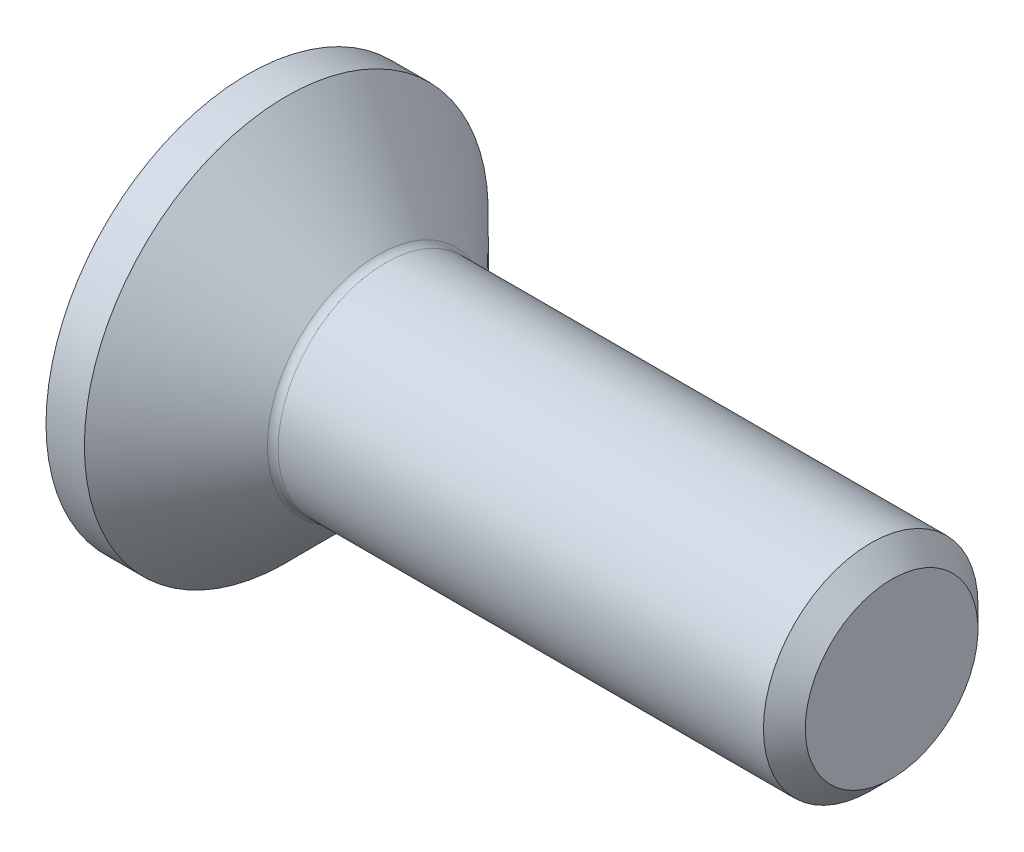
ISO-10303-21;
HEADER;
FILE_DESCRIPTION(('STEP AP214'),'2;1');
FILE_NAME('part.step','',(''),(''),'','','');
FILE_SCHEMA(('AUTOMOTIVE_DESIGN { 1 0 10303 214 1 1 1 1 }'));
ENDSEC;
DATA;
#1=APPLICATION_CONTEXT('core data for automotive mechanical design processes');
#2=APPLICATION_PROTOCOL_DEFINITION('international standard','automotive_design',2000,#1);
#3=PRODUCT_CONTEXT('',#1,'mechanical');
#4=PRODUCT('Part','Part','',(#3));
#5=PRODUCT_RELATED_PRODUCT_CATEGORY('part','',(#4));
#6=PRODUCT_DEFINITION_FORMATION('','',#4);
#7=PRODUCT_DEFINITION_CONTEXT('part definition',#1,'design');
#8=PRODUCT_DEFINITION('design','',#6,#7);
#9=PRODUCT_DEFINITION_SHAPE('','',#8);
#10=(LENGTH_UNIT() NAMED_UNIT(*) SI_UNIT(.MILLI.,.METRE.));
#11=(NAMED_UNIT(*) PLANE_ANGLE_UNIT() SI_UNIT($,.RADIAN.));
#12=(NAMED_UNIT(*) SI_UNIT($,.STERADIAN.) SOLID_ANGLE_UNIT());
#13=UNCERTAINTY_MEASURE_WITH_UNIT(LENGTH_MEASURE(1.E-05),#10,'distance_accuracy_value','');
#14=(GEOMETRIC_REPRESENTATION_CONTEXT(3) GLOBAL_UNCERTAINTY_ASSIGNED_CONTEXT((#13)) GLOBAL_UNIT_ASSIGNED_CONTEXT((#10,
#11,#12)) REPRESENTATION_CONTEXT('',''));
#15=CARTESIAN_POINT('',(0.,0.,0.));
#16=DIRECTION('',(0.,0.,1.));
#17=DIRECTION('',(1.,0.,0.));
#18=AXIS2_PLACEMENT_3D('',#15,#16,#17);
#19=CARTESIAN_POINT('',(0.,0.,0.));
#20=DIRECTION('',(-1.,0.,0.));
#21=DIRECTION('',(0.,0.,1.));
#22=AXIS2_PLACEMENT_3D('',#19,#20,#21);
#23=PLANE('',#22);
#24=CARTESIAN_POINT('',(0.,0.,0.));
#25=DIRECTION('',(-1.,0.,0.));
#26=DIRECTION('',(0.,0.,1.));
#27=AXIS2_PLACEMENT_3D('',#24,#25,#26);
#28=CIRCLE('',#27,3.765);
#29=CARTESIAN_POINT('',(0.,0.,3.765));
#30=VERTEX_POINT('',#29);
#31=EDGE_CURVE('E156',#30,#30,#28,.T.);
#32=ORIENTED_EDGE('',*,*,#31,.T.);
#33=EDGE_LOOP('',(#32));
#34=FACE_BOUND('',#33,.T.);
#35=DIRECTION('',(0.,-0.5,-0.866025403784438));
#36=VECTOR('',#35,1.);
#37=CARTESIAN_POINT('',(0.,-0.721687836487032,1.25));
#38=LINE('',#37,#36);
#39=CARTESIAN_POINT('',(0.,-0.721687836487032,1.25));
#40=VERTEX_POINT('',#39);
#41=CARTESIAN_POINT('',(0.,-1.44337567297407,0.));
#42=VERTEX_POINT('',#41);
#43=EDGE_CURVE('E118',#40,#42,#38,.T.);
#44=ORIENTED_EDGE('',*,*,#43,.T.);
#45=DIRECTION('',(0.,0.5,-0.866025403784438));
#46=VECTOR('',#45,1.);
#47=CARTESIAN_POINT('',(0.,-1.44337567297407,0.));
#48=LINE('',#47,#46);
#49=CARTESIAN_POINT('',(0.,-0.721687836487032,-1.25));
#50=VERTEX_POINT('',#49);
#51=EDGE_CURVE('E48',#42,#50,#48,.T.);
#52=ORIENTED_EDGE('',*,*,#51,.T.);
#53=DIRECTION('',(0.,1.,0.));
#54=VECTOR('',#53,1.);
#55=CARTESIAN_POINT('',(0.,-0.721687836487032,-1.25));
#56=LINE('',#55,#54);
#57=CARTESIAN_POINT('',(0.,0.721687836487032,-1.25));
#58=VERTEX_POINT('',#57);
#59=EDGE_CURVE('E133',#50,#58,#56,.T.);
#60=ORIENTED_EDGE('',*,*,#59,.T.);
#61=DIRECTION('',(0.,0.5,0.866025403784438));
#62=VECTOR('',#61,1.);
#63=CARTESIAN_POINT('',(0.,0.721687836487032,-1.25));
#64=LINE('',#63,#62);
#65=CARTESIAN_POINT('',(0.,1.44337567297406,0.));
#66=VERTEX_POINT('',#65);
#67=EDGE_CURVE('E269',#58,#66,#64,.T.);
#68=ORIENTED_EDGE('',*,*,#67,.T.);
#69=DIRECTION('',(0.,-0.5,0.866025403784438));
#70=VECTOR('',#69,1.);
#71=CARTESIAN_POINT('',(0.,1.44337567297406,0.));
#72=LINE('',#71,#70);
#73=CARTESIAN_POINT('',(0.,0.721687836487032,1.25));
#74=VERTEX_POINT('',#73);
#75=EDGE_CURVE('E272',#66,#74,#72,.T.);
#76=ORIENTED_EDGE('',*,*,#75,.T.);
#77=DIRECTION('',(0.,-1.,0.));
#78=VECTOR('',#77,1.);
#79=CARTESIAN_POINT('',(0.,0.721687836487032,1.25));
#80=LINE('',#79,#78);
#81=EDGE_CURVE('E275',#74,#40,#80,.T.);
#82=ORIENTED_EDGE('',*,*,#81,.T.);
#83=EDGE_LOOP('',(#44,#52,#60,#68,#76,#82));
#84=FACE_BOUND('',#83,.T.);
#85=ADVANCED_FACE('F33',(#34,#84),#23,.T.);
#86=CARTESIAN_POINT('',(0.,0.,0.));
#87=DIRECTION('',(-1.,0.,0.));
#88=DIRECTION('',(0.,0.,1.));
#89=AXIS2_PLACEMENT_3D('',#86,#87,#88);
#90=CYLINDRICAL_SURFACE('',#89,3.765);
#91=CARTESIAN_POINT('',(0.714999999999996,0.,0.));
#92=DIRECTION('',(-1.,0.,0.));
#93=DIRECTION('',(0.,0.,1.));
#94=AXIS2_PLACEMENT_3D('',#91,#92,#93);
#95=CIRCLE('',#94,3.765);
#96=CARTESIAN_POINT('',(0.714999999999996,0.,3.765));
#97=VERTEX_POINT('',#96);
#98=EDGE_CURVE('E153',#97,#97,#95,.T.);
#99=ORIENTED_EDGE('',*,*,#98,.T.);
#100=EDGE_LOOP('',(#99));
#101=FACE_BOUND('',#100,.T.);
#102=ORIENTED_EDGE('',*,*,#31,.F.);
#103=EDGE_LOOP('',(#102));
#104=FACE_BOUND('',#103,.T.);
#105=ADVANCED_FACE('F177',(#101,#104),#90,.T.);
#106=CARTESIAN_POINT('',(0.714999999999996,0.,0.));
#107=DIRECTION('',(-1.,0.,0.));
#108=DIRECTION('',(0.,0.,1.));
#109=AXIS2_PLACEMENT_3D('',#106,#107,#108);
#110=CONICAL_SURFACE('',#109,3.765,0.78539816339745);
#111=CARTESIAN_POINT('',(2.42142135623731,0.,0.));
#112=DIRECTION('',(-1.,0.,0.));
#113=DIRECTION('',(0.,0.,1.));
#114=AXIS2_PLACEMENT_3D('',#111,#112,#113);
#115=CIRCLE('',#114,2.05857864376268);
#116=CARTESIAN_POINT('',(2.42142135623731,0.,2.05857864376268));
#117=VERTEX_POINT('',#116);
#118=EDGE_CURVE('E41',#117,#117,#115,.T.);
#119=ORIENTED_EDGE('',*,*,#118,.T.);
#120=EDGE_LOOP('',(#119));
#121=FACE_BOUND('',#120,.T.);
#122=ORIENTED_EDGE('',*,*,#98,.F.);
#123=EDGE_LOOP('',(#122));
#124=FACE_BOUND('',#123,.T.);
#125=ADVANCED_FACE('F161',(#121,#124),#110,.T.);
#126=CARTESIAN_POINT('',(0.,0.,0.));
#127=DIRECTION('',(-1.,0.,0.));
#128=DIRECTION('',(0.,0.,1.));
#129=AXIS2_PLACEMENT_3D('',#126,#127,#128);
#130=CYLINDRICAL_SURFACE('',#129,1.99999999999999);
#131=CARTESIAN_POINT('',(2.56284271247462,0.,0.));
#132=DIRECTION('',(-1.,0.,0.));
#133=DIRECTION('',(0.,0.,1.));
#134=AXIS2_PLACEMENT_3D('',#131,#132,#133);
#135=CIRCLE('',#134,1.99999999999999);
#136=CARTESIAN_POINT('',(2.56284271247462,0.,1.99999999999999));
#137=VERTEX_POINT('',#136);
#138=EDGE_CURVE('E11',#137,#137,#135,.F.);
#139=ORIENTED_EDGE('',*,*,#138,.T.);
#140=EDGE_LOOP('',(#139));
#141=FACE_BOUND('',#140,.T.);
#142=CARTESIAN_POINT('',(11.61,0.,0.));
#143=DIRECTION('',(-1.,0.,0.));
#144=DIRECTION('',(0.,0.,1.));
#145=AXIS2_PLACEMENT_3D('',#142,#143,#144);
#146=CIRCLE('',#145,1.99999999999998);
#147=CARTESIAN_POINT('',(11.61,0.,1.99999999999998));
#148=VERTEX_POINT('',#147);
#149=EDGE_CURVE('E150',#148,#148,#146,.T.);
#150=ORIENTED_EDGE('',*,*,#149,.T.);
#151=EDGE_LOOP('',(#150));
#152=FACE_BOUND('',#151,.T.);
#153=ADVANCED_FACE('F188',(#141,#152),#130,.T.);
#154=CARTESIAN_POINT('',(12.,0.,0.));
#155=DIRECTION('',(-1.,0.,0.));
#156=DIRECTION('',(0.,0.,1.));
#157=AXIS2_PLACEMENT_3D('',#154,#155,#156);
#158=CONICAL_SURFACE('',#157,1.61,0.785398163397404);
#159=ORIENTED_EDGE('',*,*,#149,.F.);
#160=EDGE_LOOP('',(#159));
#161=FACE_BOUND('',#160,.T.);
#162=CARTESIAN_POINT('',(12.,0.,0.));
#163=DIRECTION('',(-1.,0.,0.));
#164=DIRECTION('',(0.,0.,1.));
#165=AXIS2_PLACEMENT_3D('',#162,#163,#164);
#166=CIRCLE('',#165,1.61);
#167=CARTESIAN_POINT('',(12.,0.,1.61));
#168=VERTEX_POINT('',#167);
#169=EDGE_CURVE('E146',#168,#168,#166,.T.);
#170=ORIENTED_EDGE('',*,*,#169,.T.);
#171=EDGE_LOOP('',(#170));
#172=FACE_BOUND('',#171,.T.);
#173=ADVANCED_FACE('F172',(#161,#172),#158,.T.);
#174=CARTESIAN_POINT('',(12.,1.61,0.));
#175=DIRECTION('',(1.,0.,0.));
#176=DIRECTION('',(0.,0.,-1.));
#177=AXIS2_PLACEMENT_3D('',#174,#175,#176);
#178=PLANE('',#177);
#179=ORIENTED_EDGE('',*,*,#169,.F.);
#180=EDGE_LOOP('',(#179));
#181=FACE_BOUND('',#180,.T.);
#182=ADVANCED_FACE('F165',(#181),#178,.T.);
#183=CARTESIAN_POINT('',(2.56284271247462,0.,0.));
#184=DIRECTION('',(-1.,0.,0.));
#185=DIRECTION('',(0.,0.,1.));
#186=AXIS2_PLACEMENT_3D('',#183,#184,#185);
#187=TOROIDAL_SURFACE('',#186,2.19999999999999,0.2);
#188=ORIENTED_EDGE('',*,*,#138,.F.);
#189=EDGE_LOOP('',(#188));
#190=FACE_BOUND('',#189,.T.);
#191=ORIENTED_EDGE('',*,*,#118,.F.);
#192=EDGE_LOOP('',(#191));
#193=FACE_BOUND('',#192,.T.);
#194=ADVANCED_FACE('F35',(#190,#193),#187,.F.);
#195=CARTESIAN_POINT('',(1.5,-1.44337567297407,0.));
#196=DIRECTION('',(0.,0.866025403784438,0.5));
#197=DIRECTION('',(0.,-0.5,0.866025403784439));
#198=AXIS2_PLACEMENT_3D('',#195,#196,#197);
#199=PLANE('',#198);
#200=ORIENTED_EDGE('',*,*,#51,.F.);
#201=DIRECTION('',(-1.,0.,0.));
#202=VECTOR('',#201,1.);
#203=CARTESIAN_POINT('',(1.5,-1.44337567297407,0.));
#204=LINE('',#203,#202);
#205=CARTESIAN_POINT('',(1.5,-1.44337567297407,0.));
#206=VERTEX_POINT('',#205);
#207=EDGE_CURVE('E266',#206,#42,#204,.T.);
#208=ORIENTED_EDGE('',*,*,#207,.F.);
#209=DIRECTION('',(0.,0.5,-0.866025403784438));
#210=VECTOR('',#209,1.);
#211=CARTESIAN_POINT('',(1.5,-1.44337567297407,0.));
#212=LINE('',#211,#210);
#213=CARTESIAN_POINT('',(1.5,-1.08253175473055,-0.625000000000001));
#214=VERTEX_POINT('',#213);
#215=EDGE_CURVE('E115',#206,#214,#212,.T.);
#216=ORIENTED_EDGE('',*,*,#215,.T.);
#217=CARTESIAN_POINT('',(1.5,-0.721687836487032,-1.25));
#218=VERTEX_POINT('',#217);
#219=EDGE_CURVE('E109',#214,#218,#212,.T.);
#220=ORIENTED_EDGE('',*,*,#219,.T.);
#221=DIRECTION('',(-1.,0.,0.));
#222=VECTOR('',#221,1.);
#223=CARTESIAN_POINT('',(1.5,-0.721687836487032,-1.25));
#224=LINE('',#223,#222);
#225=EDGE_CURVE('E113',#218,#50,#224,.T.);
#226=ORIENTED_EDGE('',*,*,#225,.T.);
#227=EDGE_LOOP('',(#200,#208,#216,#220,#226));
#228=FACE_BOUND('',#227,.T.);
#229=ADVANCED_FACE('F111',(#228),#199,.T.);
#230=CARTESIAN_POINT('',(1.5,-0.721687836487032,-1.25));
#231=DIRECTION('',(0.,0.,1.));
#232=DIRECTION('',(0.,-1.,0.));
#233=AXIS2_PLACEMENT_3D('',#230,#231,#232);
#234=PLANE('',#233);
#235=ORIENTED_EDGE('',*,*,#59,.F.);
#236=ORIENTED_EDGE('',*,*,#225,.F.);
#237=DIRECTION('',(0.,1.,0.));
#238=VECTOR('',#237,1.);
#239=CARTESIAN_POINT('',(1.5,-0.721687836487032,-1.25));
#240=LINE('',#239,#238);
#241=CARTESIAN_POINT('',(1.5,0.,-1.25));
#242=VERTEX_POINT('',#241);
#243=EDGE_CURVE('E121',#218,#242,#240,.T.);
#244=ORIENTED_EDGE('',*,*,#243,.T.);
#245=CARTESIAN_POINT('',(1.5,0.721687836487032,-1.25));
#246=VERTEX_POINT('',#245);
#247=EDGE_CURVE('E128',#242,#246,#240,.T.);
#248=ORIENTED_EDGE('',*,*,#247,.T.);
#249=DIRECTION('',(-1.,0.,0.));
#250=VECTOR('',#249,1.);
#251=CARTESIAN_POINT('',(1.5,0.721687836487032,-1.25));
#252=LINE('',#251,#250);
#253=EDGE_CURVE('E135',#246,#58,#252,.T.);
#254=ORIENTED_EDGE('',*,*,#253,.T.);
#255=EDGE_LOOP('',(#235,#236,#244,#248,#254));
#256=FACE_BOUND('',#255,.T.);
#257=ADVANCED_FACE('F130',(#256),#234,.T.);
#258=CARTESIAN_POINT('',(1.5,0.721687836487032,-1.25));
#259=DIRECTION('',(0.,-0.866025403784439,0.5));
#260=DIRECTION('',(0.,-0.5,-0.866025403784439));
#261=AXIS2_PLACEMENT_3D('',#258,#259,#260);
#262=PLANE('',#261);
#263=ORIENTED_EDGE('',*,*,#67,.F.);
#264=ORIENTED_EDGE('',*,*,#253,.F.);
#265=DIRECTION('',(0.,0.5,0.866025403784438));
#266=VECTOR('',#265,1.);
#267=CARTESIAN_POINT('',(1.5,0.721687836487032,-1.25));
#268=LINE('',#267,#266);
#269=CARTESIAN_POINT('',(1.5,1.08253175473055,-0.625));
#270=VERTEX_POINT('',#269);
#271=EDGE_CURVE('E258',#246,#270,#268,.T.);
#272=ORIENTED_EDGE('',*,*,#271,.T.);
#273=CARTESIAN_POINT('',(1.5,1.44337567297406,0.));
#274=VERTEX_POINT('',#273);
#275=EDGE_CURVE('E127',#270,#274,#268,.T.);
#276=ORIENTED_EDGE('',*,*,#275,.T.);
#277=DIRECTION('',(-1.,0.,0.));
#278=VECTOR('',#277,1.);
#279=CARTESIAN_POINT('',(1.5,1.44337567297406,0.));
#280=LINE('',#279,#278);
#281=EDGE_CURVE('E141',#274,#66,#280,.T.);
#282=ORIENTED_EDGE('',*,*,#281,.T.);
#283=EDGE_LOOP('',(#263,#264,#272,#276,#282));
#284=FACE_BOUND('',#283,.T.);
#285=ADVANCED_FACE('F202',(#284),#262,.T.);
#286=CARTESIAN_POINT('',(1.5,1.44337567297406,0.));
#287=DIRECTION('',(0.,-0.866025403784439,-0.5));
#288=DIRECTION('',(0.,0.5,-0.866025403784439));
#289=AXIS2_PLACEMENT_3D('',#286,#287,#288);
#290=PLANE('',#289);
#291=ORIENTED_EDGE('',*,*,#75,.F.);
#292=ORIENTED_EDGE('',*,*,#281,.F.);
#293=DIRECTION('',(0.,-0.5,0.866025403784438));
#294=VECTOR('',#293,1.);
#295=CARTESIAN_POINT('',(1.5,1.44337567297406,0.));
#296=LINE('',#295,#294);
#297=CARTESIAN_POINT('',(1.5,1.08253175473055,0.625));
#298=VERTEX_POINT('',#297);
#299=EDGE_CURVE('E56',#274,#298,#296,.T.);
#300=ORIENTED_EDGE('',*,*,#299,.T.);
#301=CARTESIAN_POINT('',(1.5,0.721687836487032,1.25));
#302=VERTEX_POINT('',#301);
#303=EDGE_CURVE('E237',#298,#302,#296,.T.);
#304=ORIENTED_EDGE('',*,*,#303,.T.);
#305=DIRECTION('',(-1.,0.,0.));
#306=VECTOR('',#305,1.);
#307=CARTESIAN_POINT('',(1.5,0.721687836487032,1.25));
#308=LINE('',#307,#306);
#309=EDGE_CURVE('E251',#302,#74,#308,.T.);
#310=ORIENTED_EDGE('',*,*,#309,.T.);
#311=EDGE_LOOP('',(#291,#292,#300,#304,#310));
#312=FACE_BOUND('',#311,.T.);
#313=ADVANCED_FACE('F205',(#312),#290,.T.);
#314=CARTESIAN_POINT('',(1.5,0.721687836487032,1.25));
#315=DIRECTION('',(0.,0.,-1.));
#316=DIRECTION('',(0.,1.,0.));
#317=AXIS2_PLACEMENT_3D('',#314,#315,#316);
#318=PLANE('',#317);
#319=ORIENTED_EDGE('',*,*,#81,.F.);
#320=ORIENTED_EDGE('',*,*,#309,.F.);
#321=DIRECTION('',(0.,-1.,0.));
#322=VECTOR('',#321,1.);
#323=CARTESIAN_POINT('',(1.5,0.721687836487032,1.25));
#324=LINE('',#323,#322);
#325=CARTESIAN_POINT('',(1.5,0.,1.25));
#326=VERTEX_POINT('',#325);
#327=EDGE_CURVE('E236',#302,#326,#324,.T.);
#328=ORIENTED_EDGE('',*,*,#327,.T.);
#329=CARTESIAN_POINT('',(1.5,-0.721687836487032,1.25));
#330=VERTEX_POINT('',#329);
#331=EDGE_CURVE('E242',#326,#330,#324,.T.);
#332=ORIENTED_EDGE('',*,*,#331,.T.);
#333=DIRECTION('',(-1.,0.,0.));
#334=VECTOR('',#333,1.);
#335=CARTESIAN_POINT('',(1.5,-0.721687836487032,1.25));
#336=LINE('',#335,#334);
#337=EDGE_CURVE('E281',#330,#40,#336,.T.);
#338=ORIENTED_EDGE('',*,*,#337,.T.);
#339=EDGE_LOOP('',(#319,#320,#328,#332,#338));
#340=FACE_BOUND('',#339,.T.);
#341=ADVANCED_FACE('F209',(#340),#318,.T.);
#342=CARTESIAN_POINT('',(1.5,-0.721687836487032,1.25));
#343=DIRECTION('',(0.,0.866025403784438,-0.5));
#344=DIRECTION('',(0.,0.5,0.866025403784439));
#345=AXIS2_PLACEMENT_3D('',#342,#343,#344);
#346=PLANE('',#345);
#347=ORIENTED_EDGE('',*,*,#43,.F.);
#348=ORIENTED_EDGE('',*,*,#337,.F.);
#349=DIRECTION('',(0.,-0.5,-0.866025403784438));
#350=VECTOR('',#349,1.);
#351=CARTESIAN_POINT('',(1.5,-0.721687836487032,1.25));
#352=LINE('',#351,#350);
#353=CARTESIAN_POINT('',(1.5,-1.08253175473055,0.625000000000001));
#354=VERTEX_POINT('',#353);
#355=EDGE_CURVE('E245',#330,#354,#352,.T.);
#356=ORIENTED_EDGE('',*,*,#355,.T.);
#357=EDGE_CURVE('E252',#354,#206,#352,.T.);
#358=ORIENTED_EDGE('',*,*,#357,.T.);
#359=ORIENTED_EDGE('',*,*,#207,.T.);
#360=EDGE_LOOP('',(#347,#348,#356,#358,#359));
#361=FACE_BOUND('',#360,.T.);
#362=ADVANCED_FACE('F212',(#361),#346,.T.);
#363=CARTESIAN_POINT('',(1.5,-1.44337567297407,0.));
#364=DIRECTION('',(-1.,0.,0.));
#365=DIRECTION('',(0.,0.,1.));
#366=AXIS2_PLACEMENT_3D('',#363,#364,#365);
#367=PLANE('',#366);
#368=CARTESIAN_POINT('',(1.5,0.,0.));
#369=DIRECTION('',(-1.,0.,0.));
#370=DIRECTION('',(0.,0.,1.));
#371=AXIS2_PLACEMENT_3D('',#368,#369,#370);
#372=CIRCLE('',#371,1.25);
#373=EDGE_CURVE('E134',#354,#326,#372,.T.);
#374=ORIENTED_EDGE('',*,*,#373,.F.);
#375=ORIENTED_EDGE('',*,*,#355,.F.);
#376=ORIENTED_EDGE('',*,*,#331,.F.);
#377=EDGE_LOOP('',(#374,#375,#376));
#378=FACE_BOUND('',#377,.T.);
#379=ADVANCED_FACE('F216',(#378),#367,.T.);
#380=EDGE_CURVE('E138',#214,#354,#372,.T.);
#381=ORIENTED_EDGE('',*,*,#380,.F.);
#382=ORIENTED_EDGE('',*,*,#215,.F.);
#383=ORIENTED_EDGE('',*,*,#357,.F.);
#384=EDGE_LOOP('',(#381,#382,#383));
#385=FACE_BOUND('',#384,.T.);
#386=ADVANCED_FACE('F219',(#385),#367,.T.);
#387=EDGE_CURVE('E123',#242,#214,#372,.T.);
#388=ORIENTED_EDGE('',*,*,#387,.F.);
#389=ORIENTED_EDGE('',*,*,#243,.F.);
#390=ORIENTED_EDGE('',*,*,#219,.F.);
#391=EDGE_LOOP('',(#388,#389,#390));
#392=FACE_BOUND('',#391,.T.);
#393=ADVANCED_FACE('F122',(#392),#367,.T.);
#394=EDGE_CURVE('E254',#270,#242,#372,.T.);
#395=ORIENTED_EDGE('',*,*,#394,.F.);
#396=ORIENTED_EDGE('',*,*,#271,.F.);
#397=ORIENTED_EDGE('',*,*,#247,.F.);
#398=EDGE_LOOP('',(#395,#396,#397));
#399=FACE_BOUND('',#398,.T.);
#400=ADVANCED_FACE('F231',(#399),#367,.T.);
#401=EDGE_CURVE('E147',#298,#270,#372,.T.);
#402=ORIENTED_EDGE('',*,*,#401,.F.);
#403=ORIENTED_EDGE('',*,*,#299,.F.);
#404=ORIENTED_EDGE('',*,*,#275,.F.);
#405=EDGE_LOOP('',(#402,#403,#404));
#406=FACE_BOUND('',#405,.T.);
#407=ADVANCED_FACE('F226',(#406),#367,.T.);
#408=EDGE_CURVE('E140',#326,#298,#372,.T.);
#409=ORIENTED_EDGE('',*,*,#408,.F.);
#410=ORIENTED_EDGE('',*,*,#327,.F.);
#411=ORIENTED_EDGE('',*,*,#303,.F.);
#412=EDGE_LOOP('',(#409,#410,#411));
#413=FACE_BOUND('',#412,.T.);
#414=ADVANCED_FACE('F197',(#413),#367,.T.);
#415=CARTESIAN_POINT('',(1.5,0.,0.));
#416=DIRECTION('',(-1.,0.,0.));
#417=DIRECTION('',(0.,0.,1.));
#418=AXIS2_PLACEMENT_3D('',#415,#416,#417);
#419=CONICAL_SURFACE('',#418,1.25,1.04719755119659);
#420=CARTESIAN_POINT('',(2.22168783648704,0.,0.));
#421=VERTEX_POINT('',#420);
#422=VERTEX_LOOP('',#421);
#423=FACE_BOUND('',#422,.T.);
#424=ORIENTED_EDGE('',*,*,#408,.T.);
#425=ORIENTED_EDGE('',*,*,#401,.T.);
#426=ORIENTED_EDGE('',*,*,#394,.T.);
#427=ORIENTED_EDGE('',*,*,#387,.T.);
#428=ORIENTED_EDGE('',*,*,#380,.T.);
#429=ORIENTED_EDGE('',*,*,#373,.T.);
#430=EDGE_LOOP('',(#424,#425,#426,#427,#428,#429));
#431=FACE_BOUND('',#430,.T.);
#432=ADVANCED_FACE('F195',(#423,#431),#419,.F.);
#433=CLOSED_SHELL('',(#85,#105,#125,#153,#173,#182,#194,#229,#257,#285,#313,#341,#362,#379,#386,
#393,#400,#407,#414,#432));
#434=MANIFOLD_SOLID_BREP('B2',#433);
#435=ADVANCED_BREP_SHAPE_REPRESENTATION('',(#18,#434),#14);
#436=SHAPE_DEFINITION_REPRESENTATION(#9,#435);
ENDSEC;
END-ISO-10303-21;
